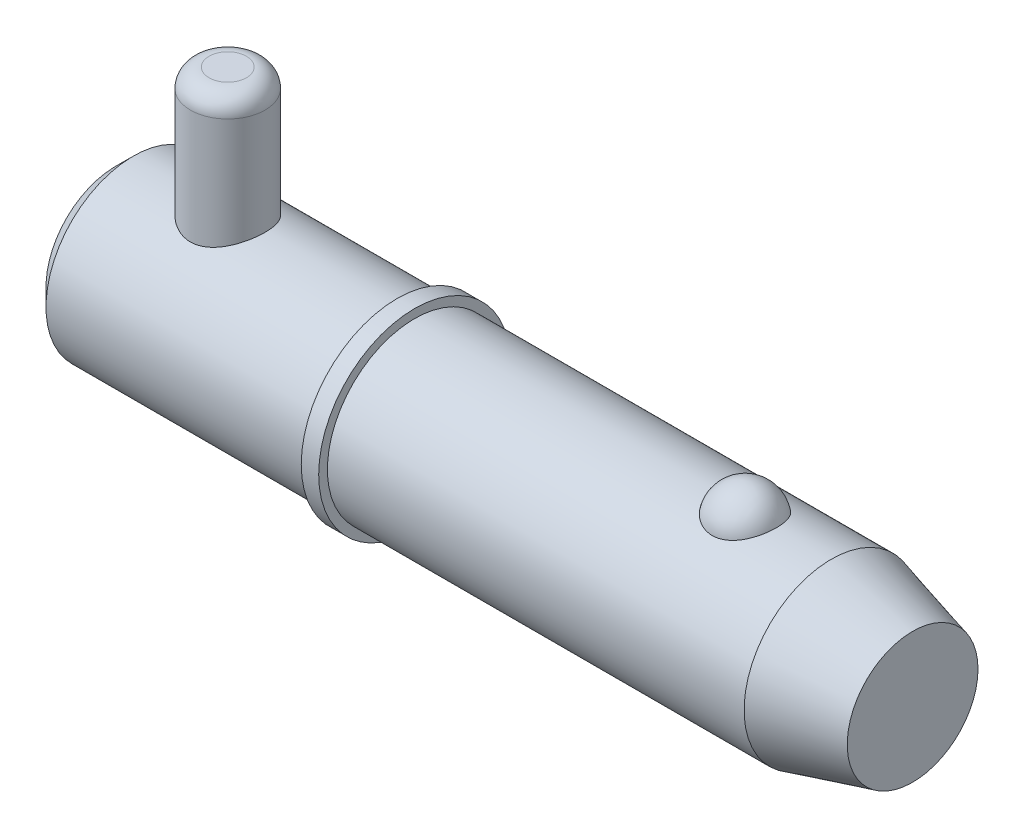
ISO-10303-21;
HEADER;
FILE_DESCRIPTION(('STEP AP214'),'2;1');
FILE_NAME('part.step','',(''),(''),'','','');
FILE_SCHEMA(('AUTOMOTIVE_DESIGN { 1 0 10303 214 1 1 1 1 }'));
ENDSEC;
DATA;
#1=APPLICATION_CONTEXT('core data for automotive mechanical design processes');
#2=APPLICATION_PROTOCOL_DEFINITION('international standard','automotive_design',2000,#1);
#3=PRODUCT_CONTEXT('',#1,'mechanical');
#4=PRODUCT('Part','Part','',(#3));
#5=PRODUCT_RELATED_PRODUCT_CATEGORY('part','',(#4));
#6=PRODUCT_DEFINITION_FORMATION('','',#4);
#7=PRODUCT_DEFINITION_CONTEXT('part definition',#1,'design');
#8=PRODUCT_DEFINITION('design','',#6,#7);
#9=PRODUCT_DEFINITION_SHAPE('','',#8);
#10=(LENGTH_UNIT() NAMED_UNIT(*) SI_UNIT(.MILLI.,.METRE.));
#11=(NAMED_UNIT(*) PLANE_ANGLE_UNIT() SI_UNIT($,.RADIAN.));
#12=(NAMED_UNIT(*) SI_UNIT($,.STERADIAN.) SOLID_ANGLE_UNIT());
#13=UNCERTAINTY_MEASURE_WITH_UNIT(LENGTH_MEASURE(1.E-05),#10,'distance_accuracy_value','');
#14=(GEOMETRIC_REPRESENTATION_CONTEXT(3) GLOBAL_UNCERTAINTY_ASSIGNED_CONTEXT((#13)) GLOBAL_UNIT_ASSIGNED_CONTEXT((#10,
#11,#12)) REPRESENTATION_CONTEXT('',''));
#15=CARTESIAN_POINT('',(0.,0.,0.));
#16=DIRECTION('',(0.,0.,1.));
#17=DIRECTION('',(1.,0.,0.));
#18=AXIS2_PLACEMENT_3D('',#15,#16,#17);
#19=CARTESIAN_POINT('',(14.28,26.985,0.));
#20=DIRECTION('',(0.,-1.,0.));
#21=DIRECTION('',(0.,0.,-1.));
#22=AXIS2_PLACEMENT_3D('',#19,#20,#21);
#23=CYLINDRICAL_SURFACE('',#22,4.76);
#24=CARTESIAN_POINT('',(14.28,-8.73500000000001,0.));
#25=DIRECTION('',(0.,1.,0.));
#26=DIRECTION('',(0.,0.,1.));
#27=AXIS2_PLACEMENT_3D('',#24,#25,#26);
#28=CIRCLE('',#27,4.76);
#29=CARTESIAN_POINT('',(14.28,-8.73500000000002,-4.76));
#30=VERTEX_POINT('',#29);
#31=EDGE_CURVE('P0_E25',#30,#30,#28,.T.);
#32=CARTESIAN_POINT('',(14.28,24.605,0.));
#33=DIRECTION('',(0.,1.,0.));
#34=DIRECTION('',(0.,0.,1.));
#35=AXIS2_PLACEMENT_3D('',#32,#33,#34);
#36=CIRCLE('',#35,4.76);
#37=CARTESIAN_POINT('',(14.28,24.605,-4.76));
#38=VERTEX_POINT('',#37);
#39=EDGE_CURVE('P0_E29',#38,#38,#36,.F.);
#40=CARTESIAN_POINT('',(14.28,-8.73500000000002,-4.76));
#41=CARTESIAN_POINT('',(14.28,-8.38770833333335,-4.76));
#42=CARTESIAN_POINT('',(14.28,-8.04041666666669,-4.76));
#43=CARTESIAN_POINT('',(14.28,-7.34583333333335,-4.76));
#44=CARTESIAN_POINT('',(14.28,-6.99854166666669,-4.76));
#45=CARTESIAN_POINT('',(14.28,-6.30395833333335,-4.76));
#46=CARTESIAN_POINT('',(14.28,-5.95666666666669,-4.76));
#47=CARTESIAN_POINT('',(14.28,-5.26208333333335,-4.76));
#48=CARTESIAN_POINT('',(14.28,-4.91479166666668,-4.76));
#49=CARTESIAN_POINT('',(14.28,-4.22020833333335,-4.76));
#50=CARTESIAN_POINT('',(14.28,-3.87291666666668,-4.76));
#51=CARTESIAN_POINT('',(14.28,-3.17833333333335,-4.76));
#52=CARTESIAN_POINT('',(14.28,-2.83104166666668,-4.76));
#53=CARTESIAN_POINT('',(14.28,-2.13645833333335,-4.76));
#54=CARTESIAN_POINT('',(14.28,-1.78916666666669,-4.76));
#55=CARTESIAN_POINT('',(14.28,-1.09458333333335,-4.76));
#56=CARTESIAN_POINT('',(14.28,-0.747291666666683,-4.76));
#57=CARTESIAN_POINT('',(14.28,-0.052708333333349,-4.76));
#58=CARTESIAN_POINT('',(14.28,0.294583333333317,-4.76));
#59=CARTESIAN_POINT('',(14.28,0.989166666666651,-4.76));
#60=CARTESIAN_POINT('',(14.28,1.33645833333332,-4.76));
#61=CARTESIAN_POINT('',(14.28,2.03104166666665,-4.76));
#62=CARTESIAN_POINT('',(14.28,2.37833333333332,-4.76));
#63=CARTESIAN_POINT('',(14.28,3.07291666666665,-4.76));
#64=CARTESIAN_POINT('',(14.28,3.42020833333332,-4.76));
#65=CARTESIAN_POINT('',(14.28,4.11479166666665,-4.76));
#66=CARTESIAN_POINT('',(14.28,4.46208333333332,-4.76));
#67=CARTESIAN_POINT('',(14.28,5.15666666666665,-4.76));
#68=CARTESIAN_POINT('',(14.28,5.50395833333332,-4.76));
#69=CARTESIAN_POINT('',(14.28,6.19854166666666,-4.76));
#70=CARTESIAN_POINT('',(14.28,6.54583333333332,-4.76));
#71=CARTESIAN_POINT('',(14.28,7.24041666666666,-4.76));
#72=CARTESIAN_POINT('',(14.28,7.58770833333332,-4.76));
#73=CARTESIAN_POINT('',(14.28,8.28229166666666,-4.76));
#74=CARTESIAN_POINT('',(14.28,8.62958333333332,-4.76));
#75=CARTESIAN_POINT('',(14.28,9.32416666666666,-4.76));
#76=CARTESIAN_POINT('',(14.28,9.67145833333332,-4.76));
#77=CARTESIAN_POINT('',(14.28,10.3660416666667,-4.76));
#78=CARTESIAN_POINT('',(14.28,10.7133333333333,-4.76));
#79=CARTESIAN_POINT('',(14.28,11.4079166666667,-4.76));
#80=CARTESIAN_POINT('',(14.28,11.7552083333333,-4.76));
#81=CARTESIAN_POINT('',(14.28,12.4497916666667,-4.76));
#82=CARTESIAN_POINT('',(14.28,12.7970833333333,-4.76));
#83=CARTESIAN_POINT('',(14.28,13.4916666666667,-4.76));
#84=CARTESIAN_POINT('',(14.28,13.8389583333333,-4.76));
#85=CARTESIAN_POINT('',(14.28,14.5335416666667,-4.76));
#86=CARTESIAN_POINT('',(14.28,14.8808333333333,-4.76));
#87=CARTESIAN_POINT('',(14.28,15.5754166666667,-4.76));
#88=CARTESIAN_POINT('',(14.28,15.9227083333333,-4.76));
#89=CARTESIAN_POINT('',(14.28,16.6172916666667,-4.76));
#90=CARTESIAN_POINT('',(14.28,16.9645833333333,-4.76));
#91=CARTESIAN_POINT('',(14.28,17.6591666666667,-4.76));
#92=CARTESIAN_POINT('',(14.28,18.0064583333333,-4.76));
#93=CARTESIAN_POINT('',(14.28,18.7010416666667,-4.76));
#94=CARTESIAN_POINT('',(14.28,19.0483333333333,-4.76));
#95=CARTESIAN_POINT('',(14.28,19.7429166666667,-4.76));
#96=CARTESIAN_POINT('',(14.28,20.0902083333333,-4.76));
#97=CARTESIAN_POINT('',(14.28,20.7847916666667,-4.76));
#98=CARTESIAN_POINT('',(14.28,21.1320833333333,-4.76));
#99=CARTESIAN_POINT('',(14.28,21.8266666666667,-4.76));
#100=CARTESIAN_POINT('',(14.28,22.1739583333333,-4.76));
#101=CARTESIAN_POINT('',(14.28,22.8685416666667,-4.76));
#102=CARTESIAN_POINT('',(14.28,23.2158333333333,-4.76));
#103=CARTESIAN_POINT('',(14.28,23.9104166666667,-4.76));
#104=CARTESIAN_POINT('',(14.28,24.2577083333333,-4.76));
#105=CARTESIAN_POINT('',(14.28,24.605,-4.76));
#106=B_SPLINE_CURVE_WITH_KNOTS('',3,(#40,#41,#42,#43,#44,#45,#46,#47,#48,#49,#50,#51,#52,#53,
#54,#55,#56,#57,#58,#59,#60,#61,#62,#63,#64,#65,#66,#67,#68,#69,#70,#71,#72,#73,#74,#75,#76,#77,
#78,#79,#80,#81,#82,#83,#84,#85,#86,#87,#88,#89,#90,#91,#92,#93,#94,#95,#96,#97,#98,#99,#100,
#101,#102,#103,#104,#105),.UNSPECIFIED.,.F.,.F.,(4,2,2,2,2,2,2,2,2,2,2,2,2,2,2,2,2,2,2,2,2,2,2,
2,2,2,2,2,2,2,2,2,4),(0.,1.041875,2.08375,3.125625,4.1675,5.209375,6.25125,7.293125,
8.33500000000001,9.376875,10.41875,11.460625,12.5025,13.544375,14.58625,15.628125,16.67,
17.711875,18.75375,19.795625,20.8375,21.879375,22.92125,23.963125,25.005,26.046875,27.08875,
28.130625,29.1725,30.214375,31.25625,32.298125,33.34),.UNSPECIFIED.);
#107=EDGE_CURVE('P0_BSEAM14',#30,#38,#106,.T.);
#108=ORIENTED_EDGE('',*,*,#31,.T.);
#109=ORIENTED_EDGE('',*,*,#39,.T.);
#110=ORIENTED_EDGE('',*,*,#107,.T.);
#111=ORIENTED_EDGE('',*,*,#107,.F.);
#112=EDGE_LOOP('',(#108,#110,#109,#111));
#113=FACE_BOUND('',#112,.T.);
#114=ADVANCED_FACE('P0_F14',(#113),#23,.T.);
#115=CARTESIAN_POINT('',(14.28,26.985,0.));
#116=DIRECTION('',(0.,1.,0.));
#117=DIRECTION('',(0.,0.,1.));
#118=AXIS2_PLACEMENT_3D('',#115,#116,#117);
#119=PLANE('',#118);
#120=CARTESIAN_POINT('',(14.28,26.985,0.));
#121=DIRECTION('',(0.,1.,0.));
#122=DIRECTION('',(0.,0.,1.));
#123=AXIS2_PLACEMENT_3D('',#120,#121,#122);
#124=CIRCLE('',#123,2.38);
#125=CARTESIAN_POINT('',(14.28,26.985,2.38));
#126=VERTEX_POINT('',#125);
#127=EDGE_CURVE('P0_E10',#126,#126,#124,.T.);
#128=ORIENTED_EDGE('',*,*,#127,.T.);
#129=EDGE_LOOP('',(#128));
#130=FACE_BOUND('',#129,.T.);
#131=ADVANCED_FACE('P0_F46',(#130),#119,.T.);
#132=CARTESIAN_POINT('',(14.28,-11.115,0.));
#133=DIRECTION('',(0.,1.,0.));
#134=DIRECTION('',(0.,0.,1.));
#135=AXIS2_PLACEMENT_3D('',#132,#133,#134);
#136=PLANE('',#135);
#137=CARTESIAN_POINT('',(14.28,-11.115,0.));
#138=DIRECTION('',(0.,1.,0.));
#139=DIRECTION('',(0.,0.,1.));
#140=AXIS2_PLACEMENT_3D('',#137,#138,#139);
#141=CIRCLE('',#140,2.38);
#142=CARTESIAN_POINT('',(14.28,-11.115,2.38));
#143=VERTEX_POINT('',#142);
#144=EDGE_CURVE('P0_E21',#143,#143,#141,.F.);
#145=ORIENTED_EDGE('',*,*,#144,.T.);
#146=EDGE_LOOP('',(#145));
#147=FACE_BOUND('',#146,.T.);
#148=ADVANCED_FACE('P0_F43',(#147),#136,.F.);
#149=CARTESIAN_POINT('',(14.28,-8.735,0.));
#150=DIRECTION('',(0.,1.,0.));
#151=DIRECTION('',(0.,0.,1.));
#152=AXIS2_PLACEMENT_3D('',#149,#150,#151);
#153=DEGENERATE_TOROIDAL_SURFACE('',#152,2.38,2.38,.T.);
#154=ORIENTED_EDGE('',*,*,#144,.F.);
#155=EDGE_LOOP('',(#154));
#156=FACE_BOUND('',#155,.T.);
#157=ORIENTED_EDGE('',*,*,#31,.F.);
#158=EDGE_LOOP('',(#157));
#159=FACE_BOUND('',#158,.T.);
#160=ADVANCED_FACE('P0_F38',(#156,#159),#153,.T.);
#161=CARTESIAN_POINT('',(14.28,24.605,0.));
#162=DIRECTION('',(0.,1.,0.));
#163=DIRECTION('',(0.,0.,1.));
#164=AXIS2_PLACEMENT_3D('',#161,#162,#163);
#165=DEGENERATE_TOROIDAL_SURFACE('',#164,2.38,2.38,.T.);
#166=ORIENTED_EDGE('',*,*,#39,.F.);
#167=EDGE_LOOP('',(#166));
#168=FACE_BOUND('',#167,.T.);
#169=ORIENTED_EDGE('',*,*,#127,.F.);
#170=EDGE_LOOP('',(#169));
#171=FACE_BOUND('',#170,.T.);
#172=ADVANCED_FACE('P0_F16',(#168,#171),#165,.T.);
#173=CLOSED_SHELL('',(#114,#131,#148,#160,#172));
#174=MANIFOLD_SOLID_BREP('P0_B1',#173);
#175=CARTESIAN_POINT('',(0.,0.,0.));
#176=DIRECTION('',(1.,0.,0.));
#177=DIRECTION('',(0.,0.,-1.));
#178=AXIS2_PLACEMENT_3D('',#175,#176,#177);
#179=CYLINDRICAL_SURFACE('',#178,11.115);
#180=CARTESIAN_POINT('',(91.229563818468,0.,0.));
#181=DIRECTION('',(1.,0.,0.));
#182=DIRECTION('',(0.,0.,-1.));
#183=AXIS2_PLACEMENT_3D('',#180,#181,#182);
#184=CIRCLE('',#183,11.115);
#185=CARTESIAN_POINT('',(91.229563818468,0.,-11.115));
#186=VERTEX_POINT('',#185);
#187=EDGE_CURVE('P1_E81',#186,#186,#184,.T.);
#188=ORIENTED_EDGE('',*,*,#187,.F.);
#189=EDGE_LOOP('',(#188));
#190=FACE_BOUND('',#189,.T.);
#191=CARTESIAN_POINT('',(38.1,0.,0.));
#192=DIRECTION('',(1.,0.,0.));
#193=DIRECTION('',(0.,0.,-1.));
#194=AXIS2_PLACEMENT_3D('',#191,#192,#193);
#195=CIRCLE('',#194,11.115);
#196=CARTESIAN_POINT('',(38.1,0.,-11.115));
#197=VERTEX_POINT('',#196);
#198=EDGE_CURVE('P1_E85',#197,#197,#195,.T.);
#199=ORIENTED_EDGE('',*,*,#198,.T.);
#200=EDGE_LOOP('',(#199));
#201=FACE_BOUND('',#200,.T.);
#202=CARTESIAN_POINT('',(80.2310680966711,10.3028087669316,4.17077409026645));
#203=CARTESIAN_POINT('',(80.0147756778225,10.3028003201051,4.17078240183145));
#204=CARTESIAN_POINT('',(79.7985488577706,10.3098895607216,4.15340593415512));
#205=CARTESIAN_POINT('',(79.3725408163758,10.3373834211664,4.08449540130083));
#206=CARTESIAN_POINT('',(79.1627577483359,10.3577841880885,4.03297121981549));
#207=CARTESIAN_POINT('',(78.7557825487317,10.4095237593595,3.89746513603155));
#208=CARTESIAN_POINT('',(78.5585726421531,10.4408466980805,3.81353029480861));
#209=CARTESIAN_POINT('',(78.1813382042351,10.5110236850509,3.61560339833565));
#210=CARTESIAN_POINT('',(78.0013171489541,10.5498792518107,3.50160528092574));
#211=CARTESIAN_POINT('',(77.6576842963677,10.6322884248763,3.24292464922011));
#212=CARTESIAN_POINT('',(77.4946861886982,10.6759443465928,3.09746040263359));
#213=CARTESIAN_POINT('',(77.1945911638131,10.7625291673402,2.78171925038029));
#214=CARTESIAN_POINT('',(77.0574990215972,10.8054579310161,2.61143778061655));
#215=CARTESIAN_POINT('',(76.8064084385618,10.8881935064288,2.24226695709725));
#216=CARTESIAN_POINT('',(76.6937105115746,10.9277761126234,2.04244123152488));
#217=CARTESIAN_POINT('',(76.5017771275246,10.997484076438,1.62578254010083));
#218=CARTESIAN_POINT('',(76.422544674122,11.0276085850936,1.40894804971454));
#219=CARTESIAN_POINT('',(76.2983034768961,11.0756732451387,0.961250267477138));
#220=CARTESIAN_POINT('',(76.253760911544,11.0934470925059,0.730239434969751));
#221=CARTESIAN_POINT('',(76.2015695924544,11.1143331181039,0.263439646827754));
#222=CARTESIAN_POINT('',(76.1939200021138,11.1174456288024,0.0276507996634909));
#223=CARTESIAN_POINT('',(76.2156105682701,11.1087161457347,-0.440729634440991));
#224=CARTESIAN_POINT('',(76.2447624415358,11.0969502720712,-0.673331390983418));
#225=CARTESIAN_POINT('',(76.3391432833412,11.0597872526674,-1.12996621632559));
#226=CARTESIAN_POINT('',(76.4043729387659,11.0343898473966,-1.35399912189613));
#227=CARTESIAN_POINT('',(76.5696984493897,10.972515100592,-1.78750286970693));
#228=CARTESIAN_POINT('',(76.6698386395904,10.9360236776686,-1.99695478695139));
#229=CARTESIAN_POINT('',(76.9029408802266,10.8557595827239,-2.3952066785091));
#230=CARTESIAN_POINT('',(77.0359054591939,10.8119863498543,-2.5840050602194));
#231=CARTESIAN_POINT('',(77.332407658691,10.7216733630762,-2.93635726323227));
#232=CARTESIAN_POINT('',(77.4960565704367,10.675123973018,-3.09981510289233));
#233=CARTESIAN_POINT('',(77.8498601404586,10.5846571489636,-3.39592247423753));
#234=CARTESIAN_POINT('',(78.0400123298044,10.5407394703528,-3.52857487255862));
#235=CARTESIAN_POINT('',(78.4375014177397,10.4616690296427,-3.75646057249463));
#236=CARTESIAN_POINT('',(78.6443670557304,10.4263443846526,-3.85245432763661));
#237=CARTESIAN_POINT('',(79.0729541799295,10.3675574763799,-4.00798747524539));
#238=CARTESIAN_POINT('',(79.294670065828,10.3440907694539,-4.06754052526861));
#239=CARTESIAN_POINT('',(79.7346695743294,10.3128282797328,-4.14614314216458));
#240=CARTESIAN_POINT('',(79.9525654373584,10.3043040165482,-4.1670783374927));
#241=CARTESIAN_POINT('',(80.3889495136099,10.3016771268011,-4.17357158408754));
#242=CARTESIAN_POINT('',(80.6074376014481,10.3075716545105,-4.15913661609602));
#243=CARTESIAN_POINT('',(81.0317442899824,10.3326686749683,-4.09636961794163));
#244=CARTESIAN_POINT('',(81.2377458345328,10.3514555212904,-4.0490957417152));
#245=CARTESIAN_POINT('',(81.6385764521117,10.399818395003,-3.92320197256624));
#246=CARTESIAN_POINT('',(81.8334046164,10.4293952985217,-3.84457953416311));
#247=CARTESIAN_POINT('',(82.2111917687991,10.4969600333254,-3.65612410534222));
#248=CARTESIAN_POINT('',(82.3937974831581,10.5351178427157,-3.54564545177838));
#249=CARTESIAN_POINT('',(82.7382040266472,10.6154999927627,-3.29718036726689));
#250=CARTESIAN_POINT('',(82.900000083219,10.657725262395,-3.15918764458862));
#251=CARTESIAN_POINT('',(83.2069596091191,10.744212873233,-2.85163580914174));
#252=CARTESIAN_POINT('',(83.3508919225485,10.7884718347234,-2.68084605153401));
#253=CARTESIAN_POINT('',(83.6092371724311,10.872374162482,-2.31721864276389));
#254=CARTESIAN_POINT('',(83.7236448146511,10.9120167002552,-2.12437704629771));
#255=CARTESIAN_POINT('',(83.9238739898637,10.9838919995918,-1.71516999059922));
#256=CARTESIAN_POINT('',(84.0086617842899,11.0158465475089,-1.498248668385));
#257=CARTESIAN_POINT('',(84.1426838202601,11.0673523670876,-1.052285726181));
#258=CARTESIAN_POINT('',(84.1919174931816,11.086903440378,-0.823243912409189));
#259=CARTESIAN_POINT('',(84.2538915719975,11.1116323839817,-0.359087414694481));
#260=CARTESIAN_POINT('',(84.2665662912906,11.1167843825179,-0.123962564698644));
#261=CARTESIAN_POINT('',(84.254973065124,11.1121144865,0.345220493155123));
#262=CARTESIAN_POINT('',(84.2307056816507,11.1022928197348,0.579278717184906));
#263=CARTESIAN_POINT('',(84.1459073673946,11.0687504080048,1.03866534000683));
#264=CARTESIAN_POINT('',(84.0855299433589,11.0450885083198,1.26402641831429));
#265=CARTESIAN_POINT('',(83.9298532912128,10.9863185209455,1.70076772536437));
#266=CARTESIAN_POINT('',(83.834551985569,10.9512097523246,1.91214712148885));
#267=CARTESIAN_POINT('',(83.6103974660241,10.8729733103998,2.31608359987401));
#268=CARTESIAN_POINT('',(83.4813806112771,10.8298068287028,2.50854240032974));
#269=CARTESIAN_POINT('',(83.1927327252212,10.7401896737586,2.86808766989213));
#270=CARTESIAN_POINT('',(83.0331022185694,10.6937390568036,3.03517457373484));
#271=CARTESIAN_POINT('',(82.6875341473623,10.6029321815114,3.33857581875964));
#272=CARTESIAN_POINT('',(82.5017089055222,10.5585680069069,3.47501541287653));
#273=CARTESIAN_POINT('',(82.1078750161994,10.4769321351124,3.71390897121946));
#274=CARTESIAN_POINT('',(81.8998635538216,10.439661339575,3.81635861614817));
#275=CARTESIAN_POINT('',(81.4540666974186,10.3749407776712,3.98910631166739));
#276=CARTESIAN_POINT('',(81.2152342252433,10.3482457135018,4.05700929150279));
#277=CARTESIAN_POINT('',(80.7279254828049,10.312188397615,4.14782844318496));
#278=CARTESIAN_POINT('',(80.4794535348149,10.3028184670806,4.17076454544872));
#279=CARTESIAN_POINT('',(80.2310680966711,10.3028087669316,4.17077409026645));
#280=B_SPLINE_CURVE_WITH_KNOTS('',3,(#202,#203,#204,#205,#206,#207,#208,#209,#210,#211,#212,
#213,#214,#215,#216,#217,#218,#219,#220,#221,#222,#223,#224,#225,#226,#227,#228,#229,#230,#231,
#232,#233,#234,#235,#236,#237,#238,#239,#240,#241,#242,#243,#244,#245,#246,#247,#248,#249,#250,
#251,#252,#253,#254,#255,#256,#257,#258,#259,#260,#261,#262,#263,#264,#265,#266,#267,#268,#269,
#270,#271,#272,#273,#274,#275,#276,#277,#278,#279),.UNSPECIFIED.,.T.,.F.,(4,2,2,2,2,2,2,2,2,2,2,
2,2,2,2,2,2,2,2,2,2,2,2,2,2,2,2,2,2,2,2,2,2,2,2,2,2,2,4),(0.,0.647966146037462,1.29574482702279,
1.94258643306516,2.58955857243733,3.25496465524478,3.92049326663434,4.61566368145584,
5.31089647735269,6.01531821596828,6.71972398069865,7.42054043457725,8.12137023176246,
8.82309331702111,9.52487047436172,10.2292439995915,10.9335519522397,11.6223330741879,
12.3108558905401,12.9647664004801,13.6185478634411,14.2521847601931,14.8858731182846,
15.5334360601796,16.1811472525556,16.8611459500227,17.5412664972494,18.2431855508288,
18.9451158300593,19.6483065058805,20.3514864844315,21.0516982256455,21.7519516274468,
22.4556690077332,23.1593743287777,23.8601491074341,24.5610129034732,25.3054529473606,
26.049562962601),.UNSPECIFIED.);
#281=CARTESIAN_POINT('',(80.2310680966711,10.3028087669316,4.17077409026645));
#282=VERTEX_POINT('',#281);
#283=EDGE_CURVE('P1_E35',#282,#282,#280,.T.);
#284=ORIENTED_EDGE('',*,*,#283,.T.);
#285=EDGE_LOOP('',(#284));
#286=FACE_BOUND('',#285,.T.);
#287=ADVANCED_FACE('P1_F13',(#190,#201,#286),#179,.T.);
#288=CARTESIAN_POINT('',(0.,0.,0.));
#289=DIRECTION('',(-1.,0.,0.));
#290=DIRECTION('',(0.,0.,1.));
#291=AXIS2_PLACEMENT_3D('',#288,#289,#290);
#292=PLANE('',#291);
#293=CARTESIAN_POINT('',(0.,0.,0.));
#294=DIRECTION('',(1.,0.,0.));
#295=DIRECTION('',(0.,0.,-1.));
#296=AXIS2_PLACEMENT_3D('',#293,#294,#295);
#297=CIRCLE('',#296,8.892);
#298=CARTESIAN_POINT('',(0.,0.,-8.892));
#299=VERTEX_POINT('',#298);
#300=EDGE_CURVE('P1_E9',#299,#299,#297,.T.);
#301=ORIENTED_EDGE('',*,*,#300,.F.);
#302=EDGE_LOOP('',(#301));
#303=FACE_BOUND('',#302,.T.);
#304=ADVANCED_FACE('P1_F15',(#303),#292,.T.);
#305=CARTESIAN_POINT('',(2.22299999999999,0.,0.));
#306=DIRECTION('',(1.,0.,0.));
#307=DIRECTION('',(0.,0.,-1.));
#308=AXIS2_PLACEMENT_3D('',#305,#306,#307);
#309=CONICAL_SURFACE('',#308,11.115,0.78539816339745);
#310=ORIENTED_EDGE('',*,*,#300,.T.);
#311=EDGE_LOOP('',(#310));
#312=FACE_BOUND('',#311,.T.);
#313=CARTESIAN_POINT('',(2.22299999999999,0.,0.));
#314=DIRECTION('',(1.,0.,0.));
#315=DIRECTION('',(0.,0.,-1.));
#316=AXIS2_PLACEMENT_3D('',#313,#314,#315);
#317=CIRCLE('',#316,11.115);
#318=CARTESIAN_POINT('',(2.22299999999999,0.,-11.115));
#319=VERTEX_POINT('',#318);
#320=EDGE_CURVE('P1_E26',#319,#319,#317,.T.);
#321=ORIENTED_EDGE('',*,*,#320,.F.);
#322=EDGE_LOOP('',(#321));
#323=FACE_BOUND('',#322,.T.);
#324=ADVANCED_FACE('P1_F77',(#312,#323),#309,.T.);
#325=CARTESIAN_POINT('',(0.,0.,0.));
#326=DIRECTION('',(1.,0.,0.));
#327=DIRECTION('',(0.,0.,-1.));
#328=AXIS2_PLACEMENT_3D('',#325,#326,#327);
#329=CYLINDRICAL_SURFACE('',#328,11.115);
#330=CARTESIAN_POINT('',(14.28,-10.0441836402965,4.76));
#331=CARTESIAN_POINT('',(14.1533731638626,-10.0441846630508,4.75999904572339));
#332=CARTESIAN_POINT('',(14.0267055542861,-10.0465865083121,4.75493985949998));
#333=CARTESIAN_POINT('',(13.774298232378,-10.0561141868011,4.73475585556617));
#334=CARTESIAN_POINT('',(13.6485591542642,-10.0632429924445,4.71962470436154));
#335=CARTESIAN_POINT('',(13.3987500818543,-10.0819979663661,4.67942666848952));
#336=CARTESIAN_POINT('',(13.2746840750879,-10.0936334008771,4.65433930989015));
#337=CARTESIAN_POINT('',(13.0293244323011,-10.1210146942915,4.59449317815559));
#338=CARTESIAN_POINT('',(12.9080319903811,-10.1367622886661,4.55973032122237));
#339=CARTESIAN_POINT('',(12.669614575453,-10.1717810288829,4.48106435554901));
#340=CARTESIAN_POINT('',(12.5524727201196,-10.1910352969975,4.4372048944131));
#341=CARTESIAN_POINT('',(12.3224300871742,-10.2325403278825,4.34063417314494));
#342=CARTESIAN_POINT('',(12.2095309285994,-10.2547922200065,4.28791957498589));
#343=CARTESIAN_POINT('',(11.8782785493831,-10.3250879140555,4.11715127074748));
#344=CARTESIAN_POINT('',(11.6670799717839,-10.3767168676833,3.98637638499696));
#345=CARTESIAN_POINT('',(11.2564039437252,-10.4874309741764,3.68567149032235));
#346=CARTESIAN_POINT('',(11.0583793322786,-10.5467772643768,3.51386978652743));
#347=CARTESIAN_POINT('',(10.6927724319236,-10.6641377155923,3.13969960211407));
#348=CARTESIAN_POINT('',(10.5252022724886,-10.7221513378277,2.93731900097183));
#349=CARTESIAN_POINT('',(10.2965609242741,-10.8050020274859,2.60935726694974));
#350=CARTESIAN_POINT('',(10.2227768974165,-10.8324811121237,2.49310321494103));
#351=CARTESIAN_POINT('',(10.0853380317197,-10.884703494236,2.25418999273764));
#352=CARTESIAN_POINT('',(10.0216789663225,-10.9094479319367,2.13153352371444));
#353=CARTESIAN_POINT('',(9.90506238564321,-10.9554932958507,1.88060370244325));
#354=CARTESIAN_POINT('',(9.85210574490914,-10.9767939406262,1.7523298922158));
#355=CARTESIAN_POINT('',(9.75746464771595,-11.0153112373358,1.49115740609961));
#356=CARTESIAN_POINT('',(9.71577447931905,-11.0325299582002,1.35826111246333));
#357=CARTESIAN_POINT('',(9.64605475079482,-11.0615607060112,1.09614539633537));
#358=CARTESIAN_POINT('',(9.61740732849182,-11.0736151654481,0.96711700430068));
#359=CARTESIAN_POINT('',(9.57092026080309,-11.0932687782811,0.706847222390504));
#360=CARTESIAN_POINT('',(9.55307574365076,-11.1008699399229,0.575606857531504));
#361=CARTESIAN_POINT('',(9.52838640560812,-11.1114054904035,0.31192917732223));
#362=CARTESIAN_POINT('',(9.52153986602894,-11.114340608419,0.179492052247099));
#363=CARTESIAN_POINT('',(9.51892405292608,-11.1154607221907,-0.0855090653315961));
#364=CARTESIAN_POINT('',(9.52315432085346,-11.1136459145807,-0.218073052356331));
#365=CARTESIAN_POINT('',(9.542009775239,-11.1055891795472,-0.473709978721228));
#366=CARTESIAN_POINT('',(9.55594693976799,-11.099640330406,-0.596843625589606));
#367=CARTESIAN_POINT('',(9.59332832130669,-11.0837823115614,-0.841440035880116));
#368=CARTESIAN_POINT('',(9.61677567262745,-11.0738718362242,-0.962902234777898));
#369=CARTESIAN_POINT('',(9.67294089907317,-11.0503378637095,-1.20325684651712));
#370=CARTESIAN_POINT('',(9.70565569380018,-11.0367156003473,-1.32215009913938));
#371=CARTESIAN_POINT('',(9.78005008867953,-11.0060908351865,-1.55666640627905));
#372=CARTESIAN_POINT('',(9.82173311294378,-10.9890870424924,-1.67228819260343));
#373=CARTESIAN_POINT('',(9.96110379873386,-10.9330280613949,-2.01656166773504));
#374=CARTESIAN_POINT('',(10.0722987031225,-10.8892801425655,-2.23915547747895));
#375=CARTESIAN_POINT('',(10.3268588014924,-10.7934745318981,-2.66299199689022));
#376=CARTESIAN_POINT('',(10.4702355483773,-10.7414138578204,-2.86422700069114));
#377=CARTESIAN_POINT('',(10.7973904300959,-10.6296201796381,-3.25557775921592));
#378=CARTESIAN_POINT('',(10.9833705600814,-10.569604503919,-3.443774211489));
#379=CARTESIAN_POINT('',(11.3844486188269,-10.4514707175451,-3.78722133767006));
#380=CARTESIAN_POINT('',(11.5995590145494,-10.3933534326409,-3.94245783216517));
#381=CARTESIAN_POINT('',(11.9444340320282,-10.311516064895,-4.14990014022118));
#382=CARTESIAN_POINT('',(12.0654579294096,-10.2847012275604,-4.21573894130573));
#383=CARTESIAN_POINT('',(12.3132718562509,-10.2342051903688,-4.33688518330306));
#384=CARTESIAN_POINT('',(12.4400593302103,-10.2105226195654,-4.39219723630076));
#385=CARTESIAN_POINT('',(12.6985418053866,-10.1671237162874,-4.49174500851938));
#386=CARTESIAN_POINT('',(12.8302359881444,-10.1474067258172,-4.53598256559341));
#387=CARTESIAN_POINT('',(13.0975061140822,-10.1126841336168,-4.61287629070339));
#388=CARTESIAN_POINT('',(13.233079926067,-10.0976759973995,-4.64553869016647));
#389=CARTESIAN_POINT('',(13.4978553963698,-10.0737863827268,-4.6971059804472));
#390=CARTESIAN_POINT('',(13.6268754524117,-10.0645618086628,-4.716785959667));
#391=CARTESIAN_POINT('',(13.8862990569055,-10.051062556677,-4.74548419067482));
#392=CARTESIAN_POINT('',(14.0167019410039,-10.0467856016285,-4.75450734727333));
#393=CARTESIAN_POINT('',(14.277859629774,-10.0433352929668,-4.76179143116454));
#394=CARTESIAN_POINT('',(14.4086143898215,-10.0441613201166,-4.76005366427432));
#395=CARTESIAN_POINT('',(14.6694025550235,-10.0508838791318,-4.74584231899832));
#396=CARTESIAN_POINT('',(14.7994359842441,-10.0567802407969,-4.73336910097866));
#397=CARTESIAN_POINT('',(15.0487369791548,-10.0728449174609,-4.69907984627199));
#398=CARTESIAN_POINT('',(15.1681238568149,-10.0826872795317,-4.67797462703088));
#399=CARTESIAN_POINT('',(15.4045894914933,-10.1062580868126,-4.62682977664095));
#400=CARTESIAN_POINT('',(15.5216674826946,-10.1199877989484,-4.59678723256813));
#401=CARTESIAN_POINT('',(15.868278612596,-10.1664161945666,-4.49365911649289));
#402=CARTESIAN_POINT('',(16.0933756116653,-10.2043671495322,-4.40754694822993));
#403=CARTESIAN_POINT('',(16.5357981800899,-10.2919879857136,-4.19898201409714));
#404=CARTESIAN_POINT('',(16.7523611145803,-10.3420954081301,-4.07511281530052));
#405=CARTESIAN_POINT('',(17.1627188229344,-10.4477911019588,-3.7959429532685));
#406=CARTESIAN_POINT('',(17.3565033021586,-10.5033818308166,-3.64062816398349));
#407=CARTESIAN_POINT('',(17.7334034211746,-10.6196376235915,-3.28693729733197));
#408=CARTESIAN_POINT('',(17.9141276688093,-10.6803237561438,-3.08599175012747));
#409=CARTESIAN_POINT('',(18.1582189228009,-10.7666348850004,-2.76320365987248));
#410=CARTESIAN_POINT('',(18.2351223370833,-10.7946346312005,-2.65197124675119));
#411=CARTESIAN_POINT('',(18.3793967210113,-10.8483267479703,-2.42297927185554));
#412=CARTESIAN_POINT('',(18.4467718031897,-10.87402011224,-2.30522255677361));
#413=CARTESIAN_POINT('',(18.5717669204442,-10.9225249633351,-2.06324665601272));
#414=CARTESIAN_POINT('',(18.6293326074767,-10.9453202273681,-1.93899615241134));
#415=CARTESIAN_POINT('',(18.73370006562,-10.9872100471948,-1.6855059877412));
#416=CARTESIAN_POINT('',(18.7805065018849,-11.0063062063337,-1.55626851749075));
#417=CARTESIAN_POINT('',(18.8628731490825,-11.0402419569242,-1.29375150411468));
#418=CARTESIAN_POINT('',(18.8984366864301,-11.0550828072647,-1.16047316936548));
#419=CARTESIAN_POINT('',(18.9579183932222,-11.0800638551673,-0.890912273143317));
#420=CARTESIAN_POINT('',(18.9818374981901,-11.0902044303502,-0.75462995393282));
#421=CARTESIAN_POINT('',(19.0164177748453,-11.104911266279,-0.490295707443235));
#422=CARTESIAN_POINT('',(19.027922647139,-11.1098318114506,-0.362373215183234));
#423=CARTESIAN_POINT('',(19.040554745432,-11.1152360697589,-0.105876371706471));
#424=CARTESIAN_POINT('',(19.0416784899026,-11.1157182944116,0.0226981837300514));
#425=CARTESIAN_POINT('',(19.0335275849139,-11.1122291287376,0.27938352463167));
#426=CARTESIAN_POINT('',(19.0242587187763,-11.1082602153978,0.407494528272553));
#427=CARTESIAN_POINT('',(18.9954320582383,-11.0959792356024,0.662388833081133));
#428=CARTESIAN_POINT('',(18.9758704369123,-11.0876655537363,0.789171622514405));
#429=CARTESIAN_POINT('',(18.9276379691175,-11.0673259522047,1.03545890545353));
#430=CARTESIAN_POINT('',(18.8993573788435,-11.0554596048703,1.15505309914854));
#431=CARTESIAN_POINT('',(18.8337694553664,-11.0282166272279,1.39134516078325));
#432=CARTESIAN_POINT('',(18.7964589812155,-11.0128387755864,1.5080420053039));
#433=CARTESIAN_POINT('',(18.671464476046,-10.9619666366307,1.85262797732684));
#434=CARTESIAN_POINT('',(18.5706772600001,-10.9217161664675,2.07521484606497));
#435=CARTESIAN_POINT('',(18.33202463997,-10.8301378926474,2.51061719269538));
#436=CARTESIAN_POINT('',(18.1926775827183,-10.7783885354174,2.72252375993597));
#437=CARTESIAN_POINT('',(17.8829747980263,-10.669863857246,3.12088015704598));
#438=CARTESIAN_POINT('',(17.7126068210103,-10.6130865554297,3.30731987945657));
#439=CARTESIAN_POINT('',(17.3310036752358,-10.495668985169,3.66358491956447));
#440=CARTESIAN_POINT('',(17.1177010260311,-10.4350471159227,3.83122543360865));
#441=CARTESIAN_POINT('',(16.7778915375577,-10.3495418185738,4.05420569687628));
#442=CARTESIAN_POINT('',(16.6612023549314,-10.3219229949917,4.12383380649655));
#443=CARTESIAN_POINT('',(16.4218466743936,-10.2693487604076,4.25306463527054));
#444=CARTESIAN_POINT('',(16.2991829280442,-10.2443921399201,4.31267191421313));
#445=CARTESIAN_POINT('',(16.0488008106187,-10.1979981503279,4.42126071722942));
#446=CARTESIAN_POINT('',(15.9210894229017,-10.1765561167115,4.47025635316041));
#447=CARTESIAN_POINT('',(15.6613937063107,-10.1379191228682,4.55720152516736));
#448=CARTESIAN_POINT('',(15.5294115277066,-10.1207220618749,4.59515652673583));
#449=CARTESIAN_POINT('',(15.2624981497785,-10.091252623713,4.65951684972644));
#450=CARTESIAN_POINT('',(15.1275757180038,-10.0789672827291,4.68595259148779));
#451=CARTESIAN_POINT('',(14.8556442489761,-10.0597530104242,4.72706206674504));
#452=CARTESIAN_POINT('',(14.7186368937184,-10.0528199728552,4.74174481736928));
#453=CARTESIAN_POINT('',(14.5310955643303,-10.047196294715,4.75363843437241));
#454=CARTESIAN_POINT('',(14.48091543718,-10.0460674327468,4.75602323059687));
#455=CARTESIAN_POINT('',(14.3804923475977,-10.044560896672,4.7592042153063));
#456=CARTESIAN_POINT('',(14.3302493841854,-10.0441832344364,4.76000037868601));
#457=CARTESIAN_POINT('',(14.28,-10.0441836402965,4.76));
#458=B_SPLINE_CURVE_WITH_KNOTS('',3,(#330,#331,#332,#333,#334,#335,#336,#337,#338,#339,#340,
#341,#342,#343,#344,#345,#346,#347,#348,#349,#350,#351,#352,#353,#354,#355,#356,#357,#358,#359,
#360,#361,#362,#363,#364,#365,#366,#367,#368,#369,#370,#371,#372,#373,#374,#375,#376,#377,#378,
#379,#380,#381,#382,#383,#384,#385,#386,#387,#388,#389,#390,#391,#392,#393,#394,#395,#396,#397,
#398,#399,#400,#401,#402,#403,#404,#405,#406,#407,#408,#409,#410,#411,#412,#413,#414,#415,#416,
#417,#418,#419,#420,#421,#422,#423,#424,#425,#426,#427,#428,#429,#430,#431,#432,#433,#434,#435,
#436,#437,#438,#439,#440,#441,#442,#443,#444,#445,#446,#447,#448,#449,#450,#451,#452,#453,#454,
#455,#456,#457),.UNSPECIFIED.,.T.,.F.,(4,2,2,2,2,2,2,2,2,2,2,2,2,2,2,2,2,2,2,2,2,2,2,2,2,2,2,2,
2,2,2,2,2,2,2,2,2,2,2,2,2,2,2,2,2,2,2,2,2,2,2,2,2,2,2,2,2,2,2,2,2,2,2,4),(0.,0.379828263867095,
0.759895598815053,1.14074858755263,1.52176256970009,1.90098898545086,2.28035867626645,
3.03818035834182,3.84125131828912,4.6446414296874,5.06541657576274,5.48601561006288,
5.90664899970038,6.3270687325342,6.72470503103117,7.12216187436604,7.51955659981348,
7.91693487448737,8.28868404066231,8.66055582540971,9.03230414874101,9.40419465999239,
10.1585834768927,10.9132435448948,11.7236471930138,12.5343987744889,12.9550196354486,
13.3754557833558,13.7958221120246,14.2159617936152,14.6079540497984,14.9997658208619,
15.3915300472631,15.7832811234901,16.1477615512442,16.512360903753,17.240999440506,
18.0012974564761,18.761937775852,19.5886929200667,20.0025782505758,20.4162843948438,
20.832212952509,21.2479608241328,21.6635855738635,22.0791769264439,22.4642880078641,
22.8495282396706,23.2345541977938,23.6197234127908,23.9896813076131,24.3597680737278,
25.099327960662,25.8726239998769,26.6462260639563,27.4759193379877,27.8914891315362,
28.3068693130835,28.7216936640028,29.1363123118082,29.5498292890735,29.9630287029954,
30.113753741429,30.2644811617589),.UNSPECIFIED.);
#459=CARTESIAN_POINT('',(14.28,-10.0441836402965,4.76));
#460=VERTEX_POINT('',#459);
#461=EDGE_CURVE('P1_E17',#460,#460,#458,.T.);
#462=ORIENTED_EDGE('',*,*,#461,.F.);
#463=EDGE_LOOP('',(#462));
#464=FACE_BOUND('',#463,.T.);
#465=CARTESIAN_POINT('',(14.28,10.0441836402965,4.76));
#466=CARTESIAN_POINT('',(14.4066268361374,10.0441846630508,4.75999904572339));
#467=CARTESIAN_POINT('',(14.5332944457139,10.0465865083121,4.75493985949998));
#468=CARTESIAN_POINT('',(14.785701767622,10.0561141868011,4.73475585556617));
#469=CARTESIAN_POINT('',(14.9114408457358,10.0632429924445,4.71962470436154));
#470=CARTESIAN_POINT('',(15.1612499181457,10.0819979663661,4.67942666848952));
#471=CARTESIAN_POINT('',(15.2853159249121,10.0936334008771,4.65433930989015));
#472=CARTESIAN_POINT('',(15.5306755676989,10.1210146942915,4.59449317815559));
#473=CARTESIAN_POINT('',(15.6519680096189,10.1367622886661,4.55973032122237));
#474=CARTESIAN_POINT('',(15.890385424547,10.1717810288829,4.48106435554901));
#475=CARTESIAN_POINT('',(16.0075272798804,10.1910352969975,4.4372048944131));
#476=CARTESIAN_POINT('',(16.2375699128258,10.2325403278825,4.34063417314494));
#477=CARTESIAN_POINT('',(16.3504690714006,10.2547922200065,4.28791957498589));
#478=CARTESIAN_POINT('',(16.6817214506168,10.3250879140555,4.11715127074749));
#479=CARTESIAN_POINT('',(16.8929200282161,10.3767168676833,3.98637638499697));
#480=CARTESIAN_POINT('',(17.3035960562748,10.4874309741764,3.68567149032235));
#481=CARTESIAN_POINT('',(17.5016206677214,10.5467772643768,3.51386978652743));
#482=CARTESIAN_POINT('',(17.8672275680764,10.6641377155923,3.13969960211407));
#483=CARTESIAN_POINT('',(18.0347977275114,10.7221513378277,2.93731900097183));
#484=CARTESIAN_POINT('',(18.2634390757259,10.8050020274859,2.60935726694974));
#485=CARTESIAN_POINT('',(18.3372231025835,10.8324811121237,2.49310321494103));
#486=CARTESIAN_POINT('',(18.4746619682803,10.884703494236,2.25418999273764));
#487=CARTESIAN_POINT('',(18.5383210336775,10.9094479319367,2.13153352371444));
#488=CARTESIAN_POINT('',(18.6549376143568,10.9554932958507,1.88060370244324));
#489=CARTESIAN_POINT('',(18.7078942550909,10.9767939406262,1.75232989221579));
#490=CARTESIAN_POINT('',(18.8025353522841,11.0153112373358,1.4911574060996));
#491=CARTESIAN_POINT('',(18.844225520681,11.0325299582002,1.35826111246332));
#492=CARTESIAN_POINT('',(18.9139452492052,11.0615607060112,1.09614539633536));
#493=CARTESIAN_POINT('',(18.9425926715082,11.0736151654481,0.967117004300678));
#494=CARTESIAN_POINT('',(18.9890797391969,11.0932687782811,0.706847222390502));
#495=CARTESIAN_POINT('',(19.0069242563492,11.1008699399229,0.575606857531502));
#496=CARTESIAN_POINT('',(19.0316135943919,11.1114054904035,0.311929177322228));
#497=CARTESIAN_POINT('',(19.0384601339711,11.114340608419,0.179492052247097));
#498=CARTESIAN_POINT('',(19.0410759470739,11.1154607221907,-0.0855090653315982));
#499=CARTESIAN_POINT('',(19.0368456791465,11.1136459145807,-0.218073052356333));
#500=CARTESIAN_POINT('',(19.017990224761,11.1055891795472,-0.47370997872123));
#501=CARTESIAN_POINT('',(19.004053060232,11.099640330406,-0.596843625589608));
#502=CARTESIAN_POINT('',(18.9666716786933,11.0837823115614,-0.841440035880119));
#503=CARTESIAN_POINT('',(18.9432243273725,11.0738718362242,-0.9629022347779));
#504=CARTESIAN_POINT('',(18.8870591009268,11.0503378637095,-1.20325684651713));
#505=CARTESIAN_POINT('',(18.8543443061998,11.0367156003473,-1.32215009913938));
#506=CARTESIAN_POINT('',(18.7799499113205,11.0060908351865,-1.55666640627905));
#507=CARTESIAN_POINT('',(18.7382668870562,10.9890870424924,-1.67228819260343));
#508=CARTESIAN_POINT('',(18.5988962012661,10.9330280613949,-2.01656166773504));
#509=CARTESIAN_POINT('',(18.4877012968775,10.8892801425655,-2.23915547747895));
#510=CARTESIAN_POINT('',(18.2331411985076,10.7934745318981,-2.66299199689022));
#511=CARTESIAN_POINT('',(18.0897644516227,10.7414138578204,-2.86422700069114));
#512=CARTESIAN_POINT('',(17.7626095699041,10.6296201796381,-3.25557775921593));
#513=CARTESIAN_POINT('',(17.5766294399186,10.569604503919,-3.443774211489));
#514=CARTESIAN_POINT('',(17.1755513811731,10.4514707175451,-3.78722133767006));
#515=CARTESIAN_POINT('',(16.9604409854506,10.3933534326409,-3.94245783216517));
#516=CARTESIAN_POINT('',(16.6155659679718,10.311516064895,-4.14990014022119));
#517=CARTESIAN_POINT('',(16.4945420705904,10.2847012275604,-4.21573894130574));
#518=CARTESIAN_POINT('',(16.2467281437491,10.2342051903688,-4.33688518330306));
#519=CARTESIAN_POINT('',(16.1199406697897,10.2105226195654,-4.39219723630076));
#520=CARTESIAN_POINT('',(15.8614581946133,10.1671237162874,-4.49174500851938));
#521=CARTESIAN_POINT('',(15.7297640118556,10.1474067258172,-4.53598256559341));
#522=CARTESIAN_POINT('',(15.4624938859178,10.1126841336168,-4.61287629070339));
#523=CARTESIAN_POINT('',(15.326920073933,10.0976759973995,-4.64553869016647));
#524=CARTESIAN_POINT('',(15.0621446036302,10.0737863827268,-4.6971059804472));
#525=CARTESIAN_POINT('',(14.9331245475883,10.0645618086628,-4.716785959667));
#526=CARTESIAN_POINT('',(14.6737009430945,10.051062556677,-4.74548419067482));
#527=CARTESIAN_POINT('',(14.543298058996,10.0467856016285,-4.75450734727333));
#528=CARTESIAN_POINT('',(14.2821403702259,10.0433352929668,-4.76179143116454));
#529=CARTESIAN_POINT('',(14.1513856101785,10.0441613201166,-4.76005366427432));
#530=CARTESIAN_POINT('',(13.8905974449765,10.0508838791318,-4.74584231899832));
#531=CARTESIAN_POINT('',(13.7605640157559,10.0567802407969,-4.73336910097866));
#532=CARTESIAN_POINT('',(13.5112630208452,10.0728449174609,-4.69907984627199));
#533=CARTESIAN_POINT('',(13.3918761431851,10.0826872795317,-4.67797462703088));
#534=CARTESIAN_POINT('',(13.1554105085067,10.1062580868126,-4.62682977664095));
#535=CARTESIAN_POINT('',(13.0383325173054,10.1199877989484,-4.59678723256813));
#536=CARTESIAN_POINT('',(12.691721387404,10.1664161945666,-4.49365911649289));
#537=CARTESIAN_POINT('',(12.4666243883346,10.2043671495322,-4.40754694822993));
#538=CARTESIAN_POINT('',(12.0242018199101,10.2919879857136,-4.19898201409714));
#539=CARTESIAN_POINT('',(11.8076388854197,10.3420954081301,-4.07511281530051));
#540=CARTESIAN_POINT('',(11.3972811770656,10.4477911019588,-3.7959429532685));
#541=CARTESIAN_POINT('',(11.2034966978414,10.5033818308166,-3.64062816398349));
#542=CARTESIAN_POINT('',(10.8265965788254,10.6196376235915,-3.28693729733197));
#543=CARTESIAN_POINT('',(10.6458723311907,10.6803237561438,-3.08599175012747));
#544=CARTESIAN_POINT('',(10.4017810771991,10.7666348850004,-2.76320365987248));
#545=CARTESIAN_POINT('',(10.3248776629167,10.7946346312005,-2.65197124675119));
#546=CARTESIAN_POINT('',(10.1806032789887,10.8483267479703,-2.42297927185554));
#547=CARTESIAN_POINT('',(10.1132281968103,10.87402011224,-2.30522255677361));
#548=CARTESIAN_POINT('',(9.98823307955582,10.9225249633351,-2.06324665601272));
#549=CARTESIAN_POINT('',(9.93066739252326,10.9453202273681,-1.93899615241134));
#550=CARTESIAN_POINT('',(9.82629993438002,10.9872100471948,-1.6855059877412));
#551=CARTESIAN_POINT('',(9.77949349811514,11.0063062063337,-1.55626851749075));
#552=CARTESIAN_POINT('',(9.69712685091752,11.0402419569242,-1.29375150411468));
#553=CARTESIAN_POINT('',(9.66156331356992,11.0550828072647,-1.16047316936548));
#554=CARTESIAN_POINT('',(9.60208160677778,11.0800638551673,-0.890912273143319));
#555=CARTESIAN_POINT('',(9.57816250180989,11.0902044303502,-0.754629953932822));
#556=CARTESIAN_POINT('',(9.54358222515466,11.104911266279,-0.490295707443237));
#557=CARTESIAN_POINT('',(9.53207735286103,11.1098318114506,-0.362373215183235));
#558=CARTESIAN_POINT('',(9.51944525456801,11.1152360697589,-0.105876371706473));
#559=CARTESIAN_POINT('',(9.51832151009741,11.1157182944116,0.0226981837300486));
#560=CARTESIAN_POINT('',(9.52647241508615,11.1122291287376,0.279383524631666));
#561=CARTESIAN_POINT('',(9.53574128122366,11.1082602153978,0.407494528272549));
#562=CARTESIAN_POINT('',(9.5645679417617,11.0959792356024,0.662388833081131));
#563=CARTESIAN_POINT('',(9.58412956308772,11.0876655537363,0.789171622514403));
#564=CARTESIAN_POINT('',(9.63236203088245,11.0673259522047,1.03545890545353));
#565=CARTESIAN_POINT('',(9.66064262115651,11.0554596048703,1.15505309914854));
#566=CARTESIAN_POINT('',(9.72623054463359,11.0282166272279,1.39134516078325));
#567=CARTESIAN_POINT('',(9.76354101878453,11.0128387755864,1.5080420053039));
#568=CARTESIAN_POINT('',(9.88853552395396,10.9619666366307,1.85262797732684));
#569=CARTESIAN_POINT('',(9.98932273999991,10.9217161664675,2.07521484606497));
#570=CARTESIAN_POINT('',(10.22797536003,10.8301378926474,2.51061719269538));
#571=CARTESIAN_POINT('',(10.3673224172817,10.7783885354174,2.72252375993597));
#572=CARTESIAN_POINT('',(10.6770252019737,10.669863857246,3.12088015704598));
#573=CARTESIAN_POINT('',(10.8473931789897,10.6130865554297,3.30731987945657));
#574=CARTESIAN_POINT('',(11.2289963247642,10.495668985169,3.66358491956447));
#575=CARTESIAN_POINT('',(11.4422989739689,10.4350471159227,3.83122543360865));
#576=CARTESIAN_POINT('',(11.7821084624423,10.3495418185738,4.05420569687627));
#577=CARTESIAN_POINT('',(11.8987976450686,10.3219229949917,4.12383380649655));
#578=CARTESIAN_POINT('',(12.1381533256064,10.2693487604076,4.25306463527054));
#579=CARTESIAN_POINT('',(12.2608170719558,10.2443921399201,4.31267191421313));
#580=CARTESIAN_POINT('',(12.5111991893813,10.1979981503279,4.42126071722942));
#581=CARTESIAN_POINT('',(12.6389105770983,10.1765561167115,4.47025635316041));
#582=CARTESIAN_POINT('',(12.8986062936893,10.1379191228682,4.55720152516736));
#583=CARTESIAN_POINT('',(13.0305884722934,10.1207220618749,4.59515652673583));
#584=CARTESIAN_POINT('',(13.2975018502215,10.091252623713,4.65951684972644));
#585=CARTESIAN_POINT('',(13.4324242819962,10.0789672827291,4.68595259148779));
#586=CARTESIAN_POINT('',(13.7043557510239,10.0597530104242,4.72706206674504));
#587=CARTESIAN_POINT('',(13.8413631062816,10.0528199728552,4.74174481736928));
#588=CARTESIAN_POINT('',(14.0289044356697,10.047196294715,4.75363843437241));
#589=CARTESIAN_POINT('',(14.07908456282,10.0460674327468,4.75602323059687));
#590=CARTESIAN_POINT('',(14.1795076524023,10.044560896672,4.7592042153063));
#591=CARTESIAN_POINT('',(14.2297506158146,10.0441832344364,4.76000037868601));
#592=CARTESIAN_POINT('',(14.28,10.0441836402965,4.76));
#593=B_SPLINE_CURVE_WITH_KNOTS('',3,(#465,#466,#467,#468,#469,#470,#471,#472,#473,#474,#475,
#476,#477,#478,#479,#480,#481,#482,#483,#484,#485,#486,#487,#488,#489,#490,#491,#492,#493,#494,
#495,#496,#497,#498,#499,#500,#501,#502,#503,#504,#505,#506,#507,#508,#509,#510,#511,#512,#513,
#514,#515,#516,#517,#518,#519,#520,#521,#522,#523,#524,#525,#526,#527,#528,#529,#530,#531,#532,
#533,#534,#535,#536,#537,#538,#539,#540,#541,#542,#543,#544,#545,#546,#547,#548,#549,#550,#551,
#552,#553,#554,#555,#556,#557,#558,#559,#560,#561,#562,#563,#564,#565,#566,#567,#568,#569,#570,
#571,#572,#573,#574,#575,#576,#577,#578,#579,#580,#581,#582,#583,#584,#585,#586,#587,#588,#589,
#590,#591,#592),.UNSPECIFIED.,.T.,.F.,(4,2,2,2,2,2,2,2,2,2,2,2,2,2,2,2,2,2,2,2,2,2,2,2,2,2,2,2,
2,2,2,2,2,2,2,2,2,2,2,2,2,2,2,2,2,2,2,2,2,2,2,2,2,2,2,2,2,2,2,2,2,2,2,4),(0.,0.379828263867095,
0.759895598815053,1.14074858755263,1.52176256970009,1.90098898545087,2.28035867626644,
3.03818035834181,3.84125131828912,4.6446414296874,5.06541657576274,5.48601561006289,
5.90664899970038,6.3270687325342,6.72470503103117,7.12216187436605,7.51955659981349,
7.91693487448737,8.28868404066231,8.66055582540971,9.03230414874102,9.4041946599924,
10.1585834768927,10.9132435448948,11.7236471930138,12.5343987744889,12.9550196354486,
13.3754557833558,13.7958221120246,14.2159617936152,14.6079540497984,14.9997658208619,
15.3915300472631,15.7832811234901,16.1477615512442,16.512360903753,17.240999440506,
18.0012974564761,18.761937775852,19.5886929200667,20.0025782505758,20.4162843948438,
20.832212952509,21.2479608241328,21.6635855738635,22.0791769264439,22.4642880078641,
22.8495282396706,23.2345541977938,23.6197234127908,23.9896813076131,24.3597680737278,
25.099327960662,25.8726239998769,26.6462260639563,27.4759193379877,27.8914891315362,
28.3068693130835,28.7216936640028,29.1363123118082,29.5498292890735,29.9630287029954,
30.113753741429,30.2644811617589),.UNSPECIFIED.);
#594=CARTESIAN_POINT('',(14.28,10.0441836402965,4.76));
#595=VERTEX_POINT('',#594);
#596=EDGE_CURVE('P1_E43',#595,#595,#593,.T.);
#597=ORIENTED_EDGE('',*,*,#596,.F.);
#598=EDGE_LOOP('',(#597));
#599=FACE_BOUND('',#598,.T.);
#600=ORIENTED_EDGE('',*,*,#320,.T.);
#601=EDGE_LOOP('',(#600));
#602=FACE_BOUND('',#601,.T.);
#603=CARTESIAN_POINT('',(35.877,0.,0.));
#604=DIRECTION('',(1.,0.,0.));
#605=DIRECTION('',(0.,0.,-1.));
#606=AXIS2_PLACEMENT_3D('',#603,#604,#605);
#607=CIRCLE('',#606,11.115);
#608=CARTESIAN_POINT('',(35.877,0.,-11.115));
#609=VERTEX_POINT('',#608);
#610=EDGE_CURVE('P1_E31',#609,#609,#607,.T.);
#611=ORIENTED_EDGE('',*,*,#610,.F.);
#612=EDGE_LOOP('',(#611));
#613=FACE_BOUND('',#612,.T.);
#614=ADVANCED_FACE('P1_F103',(#464,#599,#602,#613),#329,.T.);
#615=CARTESIAN_POINT('',(35.877,11.115,0.));
#616=DIRECTION('',(-1.,0.,0.));
#617=DIRECTION('',(0.,0.,1.));
#618=AXIS2_PLACEMENT_3D('',#615,#616,#617);
#619=PLANE('',#618);
#620=ORIENTED_EDGE('',*,*,#610,.T.);
#621=EDGE_LOOP('',(#620));
#622=FACE_BOUND('',#621,.T.);
#623=CARTESIAN_POINT('',(35.877,0.,0.));
#624=DIRECTION('',(1.,0.,0.));
#625=DIRECTION('',(0.,0.,-1.));
#626=AXIS2_PLACEMENT_3D('',#623,#624,#625);
#627=CIRCLE('',#626,12.2265);
#628=CARTESIAN_POINT('',(35.877,0.,-12.2265));
#629=VERTEX_POINT('',#628);
#630=EDGE_CURVE('P1_E91',#629,#629,#627,.T.);
#631=ORIENTED_EDGE('',*,*,#630,.F.);
#632=EDGE_LOOP('',(#631));
#633=FACE_BOUND('',#632,.T.);
#634=ADVANCED_FACE('P1_F100',(#622,#633),#619,.T.);
#635=CARTESIAN_POINT('',(0.,0.,0.));
#636=DIRECTION('',(1.,0.,0.));
#637=DIRECTION('',(0.,0.,-1.));
#638=AXIS2_PLACEMENT_3D('',#635,#636,#637);
#639=CYLINDRICAL_SURFACE('',#638,12.2265);
#640=ORIENTED_EDGE('',*,*,#630,.T.);
#641=EDGE_LOOP('',(#640));
#642=FACE_BOUND('',#641,.T.);
#643=CARTESIAN_POINT('',(38.1,0.,0.));
#644=DIRECTION('',(1.,0.,0.));
#645=DIRECTION('',(0.,0.,-1.));
#646=AXIS2_PLACEMENT_3D('',#643,#644,#645);
#647=CIRCLE('',#646,12.2265);
#648=CARTESIAN_POINT('',(38.1,0.,-12.2265));
#649=VERTEX_POINT('',#648);
#650=EDGE_CURVE('P1_E88',#649,#649,#647,.T.);
#651=ORIENTED_EDGE('',*,*,#650,.F.);
#652=EDGE_LOOP('',(#651));
#653=FACE_BOUND('',#652,.T.);
#654=ADVANCED_FACE('P1_F68',(#642,#653),#639,.T.);
#655=CARTESIAN_POINT('',(38.1,12.2265,0.));
#656=DIRECTION('',(1.,0.,0.));
#657=DIRECTION('',(0.,0.,-1.));
#658=AXIS2_PLACEMENT_3D('',#655,#656,#657);
#659=PLANE('',#658);
#660=ORIENTED_EDGE('',*,*,#650,.T.);
#661=EDGE_LOOP('',(#660));
#662=FACE_BOUND('',#661,.T.);
#663=ORIENTED_EDGE('',*,*,#198,.F.);
#664=EDGE_LOOP('',(#663));
#665=FACE_BOUND('',#664,.T.);
#666=ADVANCED_FACE('P1_F62',(#662,#665),#659,.T.);
#667=CARTESIAN_POINT('',(101.6,0.,0.));
#668=DIRECTION('',(-1.,0.,0.));
#669=DIRECTION('',(0.,0.,1.));
#670=AXIS2_PLACEMENT_3D('',#667,#668,#669);
#671=CONICAL_SURFACE('',#670,8.33625000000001,0.26179938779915);
#672=ORIENTED_EDGE('',*,*,#187,.T.);
#673=EDGE_LOOP('',(#672));
#674=FACE_BOUND('',#673,.T.);
#675=CARTESIAN_POINT('',(101.6,0.,0.));
#676=DIRECTION('',(1.,0.,0.));
#677=DIRECTION('',(0.,0.,-1.));
#678=AXIS2_PLACEMENT_3D('',#675,#676,#677);
#679=CIRCLE('',#678,8.33625000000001);
#680=CARTESIAN_POINT('',(101.6,0.,-8.33625000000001));
#681=VERTEX_POINT('',#680);
#682=EDGE_CURVE('P1_E42',#681,#681,#679,.T.);
#683=ORIENTED_EDGE('',*,*,#682,.F.);
#684=EDGE_LOOP('',(#683));
#685=FACE_BOUND('',#684,.T.);
#686=ADVANCED_FACE('P1_F59',(#674,#685),#671,.T.);
#687=CARTESIAN_POINT('',(101.6,8.33625000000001,0.));
#688=DIRECTION('',(1.,0.,0.));
#689=DIRECTION('',(0.,0.,-1.));
#690=AXIS2_PLACEMENT_3D('',#687,#688,#689);
#691=PLANE('',#690);
#692=ORIENTED_EDGE('',*,*,#682,.T.);
#693=EDGE_LOOP('',(#692));
#694=FACE_BOUND('',#693,.T.);
#695=ADVANCED_FACE('P1_F55',(#694),#691,.T.);
#696=CARTESIAN_POINT('',(80.2310680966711,10.0035,0.));
#697=DIRECTION('',(-1.,0.,0.));
#698=DIRECTION('',(0.,1.,0.));
#699=AXIS2_PLACEMENT_3D('',#696,#697,#698);
#700=SPHERICAL_SURFACE('',#699,4.18150000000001);
#701=ORIENTED_EDGE('',*,*,#283,.F.);
#702=EDGE_LOOP('',(#701));
#703=FACE_BOUND('',#702,.T.);
#704=ADVANCED_FACE('P1_F50',(#703),#700,.T.);
#705=CARTESIAN_POINT('',(14.28,-12.2265,0.));
#706=DIRECTION('',(0.,1.,0.));
#707=DIRECTION('',(0.,0.,1.));
#708=AXIS2_PLACEMENT_3D('',#705,#706,#707);
#709=CYLINDRICAL_SURFACE('',#708,4.76);
#710=ORIENTED_EDGE('',*,*,#461,.T.);
#711=EDGE_LOOP('',(#710));
#712=FACE_BOUND('',#711,.T.);
#713=ORIENTED_EDGE('',*,*,#596,.T.);
#714=EDGE_LOOP('',(#713));
#715=FACE_BOUND('',#714,.T.);
#716=ADVANCED_FACE('P1_F54',(#712,#715),#709,.F.);
#717=CLOSED_SHELL('',(#287,#304,#324,#614,#634,#654,#666,#686,#695,#704,#716));
#718=MANIFOLD_SOLID_BREP('P1_B1',#717);
#719=ADVANCED_BREP_SHAPE_REPRESENTATION('',(#18,#174,#718),#14);
#720=SHAPE_DEFINITION_REPRESENTATION(#9,#719);
ENDSEC;
END-ISO-10303-21;
